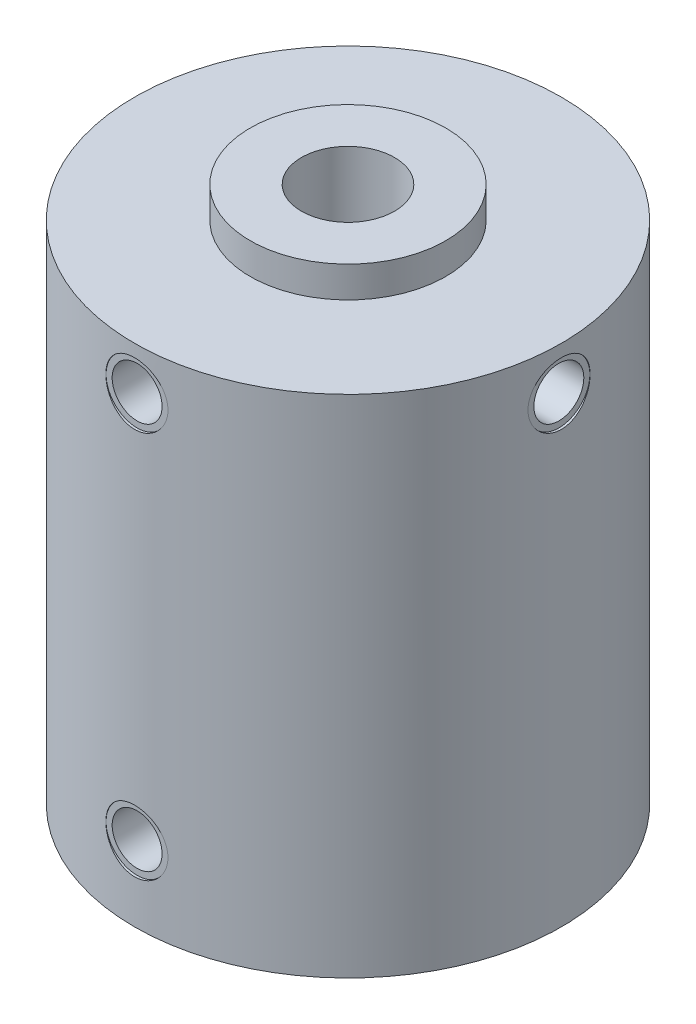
from build123d import *

# Parameters (mm, degrees)
SKETCH1_R                    = 21.8186
EXTRUDE1_DEPTH               = 54.864
SKETCH2_R                    = 4.7625
CUT_EXTRUDE1_DEPTH           = 20.828
SKETCH3_R                    = 6.35
CUT_EXTRUDE2_DEPTH           = 20.828
SKETCH4_R                    = 22.225
SKETCH4_R_2                  = 9.9949
CUT_EXTRUDE3_DEPTH           = 3.175
CUT_EXTRUDE5_DEPTH           = 1.5875
CUT_EXTRUDE5_DEPTH_BACK      = 2.54
SKETCH5_W                    = 3.175
SKETCH5_H                    = 21.336
SKETCH6_R                    = 3.175
CUT_EXTRUDE6_DEPTH           = 0.254
F_1_4_20_TAPPED_HOLE1_REACH  = 69.751
F_1_4_20_TAPPED_HOLE1_BORE_R = 2.5527
SKETCH13_R                   = 3.175
CUT_EXTRUDE7_DEPTH           = 0.254
F_1_4_20_TAPPED_HOLE4_REACH  = 69.751
F_1_4_20_TAPPED_HOLE4_BORE_R = 2.5527


with BuildPart() as part:
    # Sketch1 → Extrude1 (new body)
    with BuildSketch(Plane(origin=(0, 0, 0), x_dir=(1, 0, 0), z_dir=(0, 1, 0))):
        with Locations(Location((0, 0, 0), (0, 0, 270))):
            Circle(SKETCH1_R)
    extrude(amount=EXTRUDE1_DEPTH)

    # Sketch2 → Cut-Extrude1 (cut)
    with BuildSketch(Plane(origin=(0, 54.864, 0), x_dir=(-1, 0, 0), z_dir=(0, 1, 0))):
        with Locations(Location((0, 0, 0), (0, 0, 90))):
            Circle(SKETCH2_R)
    extrude(amount=-CUT_EXTRUDE1_DEPTH, mode=Mode.SUBTRACT)

    # Sketch3 → Cut-Extrude2 (cut)
    with BuildSketch(Plane.XZ):
        with Locations(Location((0, 0, 0), (0, 0, 270))):
            Circle(SKETCH3_R)
    extrude(amount=-CUT_EXTRUDE2_DEPTH, mode=Mode.SUBTRACT)

    # Sketch4 → Cut-Extrude3 (cut)
    with BuildSketch(Plane.XZ.offset(-54.864)):
        Circle(SKETCH4_R)
        with Locations(Location((0, 0, 0), (0, 0, 270))):
            Circle(SKETCH4_R_2, mode=Mode.SUBTRACT)
    extrude(amount=CUT_EXTRUDE3_DEPTH, mode=Mode.SUBTRACT)

    # Sketch5 → Cut-Extrude5 (cut, two sides: drawn at the far end of the back side and taken through both)
    with BuildSketch(Plane.XY.offset(6.35).offset(-CUT_EXTRUDE5_DEPTH_BACK)):
        with Locations((0, 10.668)):
            Rectangle(SKETCH5_W, SKETCH5_H)
    extrude(amount=CUT_EXTRUDE5_DEPTH + CUT_EXTRUDE5_DEPTH_BACK, mode=Mode.SUBTRACT)

    # Sketch6 → Cut-Extrude6 (cut)
    with BuildSketch(Plane.XY.offset(21.8186)):
        with Locations((0, 47.244)):
            Circle(SKETCH6_R)
    cut_extrude6 = extrude(amount=-CUT_EXTRUDE6_DEPTH, mode=Mode.SUBTRACT)

    # 1_4-20 Tapped Hole1 bore (on position points) → 1_4-20 Tapped Hole1 (cut, up to next)
    with BuildSketch(Plane(origin=(0, 47.244, 21.5646), x_dir=(0, 1, 0), z_dir=(0, 0, 1)), mode=Mode.PRIVATE) as f_1_4_20_tapped_hole1_sk1:
        Circle(F_1_4_20_TAPPED_HOLE1_BORE_R)
    f_1_4_20_tapped_hole1_tool1 = extrude(f_1_4_20_tapped_hole1_sk1.sketch, amount=-F_1_4_20_TAPPED_HOLE1_REACH, mode=Mode.PRIVATE) & part.part
    f_1_4_20_tapped_hole1 = f_1_4_20_tapped_hole1_tool1.solids().sort_by_distance((0, 47.244, 21.5646))[0]
    add(f_1_4_20_tapped_hole1, mode=Mode.SUBTRACT)

    # Sketch13 → Cut-Extrude7 (cut)
    with BuildSketch(Plane(origin=(21.8186, 0, 0), x_dir=(0, 0, -1), z_dir=(1, 0, 0))):
        with Locations((0, 47.244)):
            Circle(SKETCH13_R)
    extrude(amount=-CUT_EXTRUDE7_DEPTH, mode=Mode.SUBTRACT)

    # 1_4-20 Tapped Hole4 bore (on position points) → 1_4-20 Tapped Hole4 (cut, up to next)
    with BuildSketch(Plane(origin=(21.5646, 47.244, 0), x_dir=(0, 0, 1), z_dir=(1, 0, 0)), mode=Mode.PRIVATE) as f_1_4_20_tapped_hole4_sk1:
        Circle(F_1_4_20_TAPPED_HOLE4_BORE_R)
    f_1_4_20_tapped_hole4_tool1 = extrude(f_1_4_20_tapped_hole4_sk1.sketch, amount=-F_1_4_20_TAPPED_HOLE4_REACH, mode=Mode.PRIVATE) & part.part
    add(f_1_4_20_tapped_hole4_tool1.solids().sort_by_distance((21.5646, 47.244, 0))[0], mode=Mode.SUBTRACT)

    # Mirror1: Cut-Extrude6, 1_4-20 Tapped Hole1 across plane
    add(cut_extrude6.mirror(Plane.ZX.offset(27.432)), mode=Mode.SUBTRACT)
    add(f_1_4_20_tapped_hole1.mirror(Plane.ZX.offset(27.432)), mode=Mode.SUBTRACT)


solid = part.part
